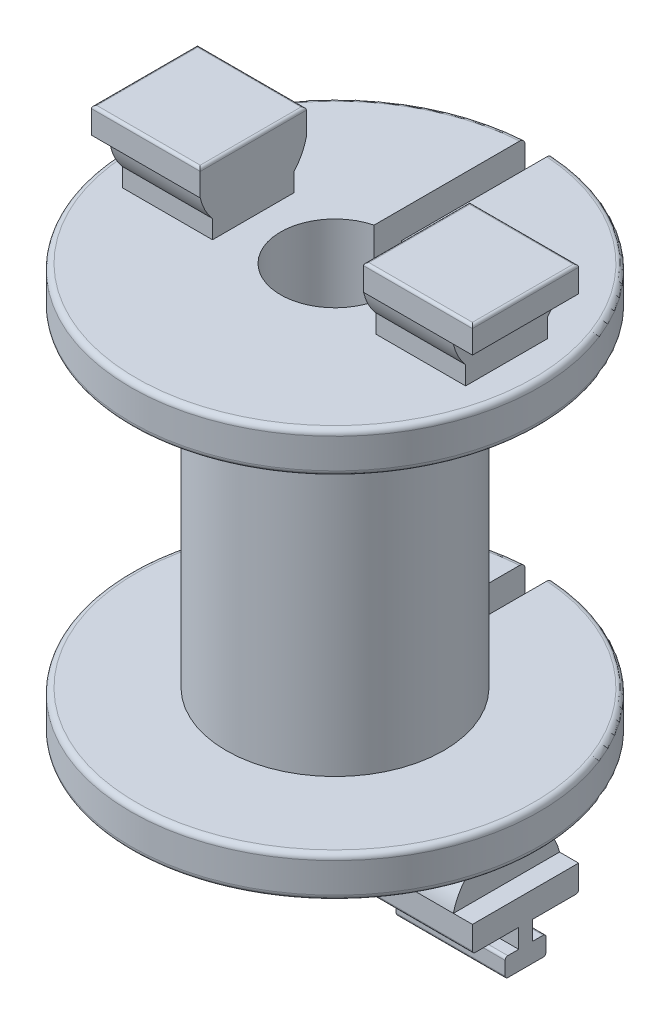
from build123d import *

# Parameters (mm, degrees)
SKETCH_1_R               = 7.5
EXTRUDE_1_DEPTH          = 1.5
SKETCH_2_R               = 4
EXTRUDE_2_DEPTH          = 12
SKETCH_3_R               = 7.5
EXTRUDE_3_DEPTH          = 1.5
SKETCH_4_R               = 2
CUT_EXTRUDE_1_DEPTH      = 19.371173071
EXTRUDE_4_DEPTH          = 6.3
SKETCH_6_W               = 3.9
SKETCH_6_H               = 0.944409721
EXTRUDE_5_DEPTH          = 0.7
CUT_EXTRUDE_2_DEPTH      = 21.46338193
MIRROR_2_COPY_1_SKETCH_W = 3.9
MIRROR_2_COPY_1_SKETCH_H = 0.944409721
MIRROR_2_COPY_1_DEPTH    = 0.7
EXTRUDE_6_DEPTH          = 7
EXTRUDE_6_DEPTH_BACK     = 7
CUT_EXTRUDE_3_DEPTH      = 21.46338193
CUT_EXTRUDE_3_DEPTH_BACK = 21.46338193
SKETCH_9_W               = 6
SKETCH_9_H               = 1.4
SKETCH_10_W              = 1
SKETCH_10_H              = 9
CUT_EXTRUDE_4_DEPTH      = 22.672794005
FILLET_1_R               = 0.2
FILLET_2_R               = 0.1


with BuildPart() as part:
    # Sketch 1 → Extrude 1 (new body)
    with BuildSketch(Plane(origin=(0, 0, 0), x_dir=(1, 0, 0), z_dir=(0, 1, 0))):
        with Locations(Location((0, 0, 0), (0, 0, 270))):
            Circle(SKETCH_1_R)
    extrude(amount=EXTRUDE_1_DEPTH)

    # Sketch 2 → Extrude 2 (add)
    with BuildSketch(Plane(origin=(0, 1.5, 0), x_dir=(1, 0, 0), z_dir=(0, 1, 0))):
        with Locations(Location((0, 0, 0), (0, 0, 270))):
            Circle(SKETCH_2_R)
    extrude(amount=EXTRUDE_2_DEPTH)

    # Sketch 3 → Extrude 3 (add)
    with BuildSketch(Plane(origin=(0, 13.5, 0), x_dir=(1, 0, 0), z_dir=(0, 1, 0))):
        with Locations(Location((0, 0, 0), (0, 0, 270))):
            Circle(SKETCH_3_R)
    extrude(amount=EXTRUDE_3_DEPTH)

    # Sketch 4 → Cut-Extrude 1 (cut, through all)
    with BuildSketch(Plane(origin=(0, 15, 0), x_dir=(1, 0, 0), z_dir=(0, 1, 0))):
        with Locations(Location((0, 0, 0), (0, 0, 270))):
            Circle(SKETCH_4_R)
    extrude(amount=-CUT_EXTRUDE_1_DEPTH, mode=Mode.SUBTRACT)

    # Sketch 5 → Extrude 4 (add, symmetric)
    with BuildSketch(Plane(origin=(0, 0, 0), x_dir=(0, 0, -1), z_dir=(1, 0, 0))):
        with BuildLine():
            Line((1.5, 15), (-1.5, 15))
            Line((-1.5, 15), (-1.5, 15.677124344))
            ThreePointArc((-1.5, 15.677124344), (-1.780042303, 16.088161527), (-1.95, 16.555590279))
            Line((-1.95, 16.555590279), (-1.95, 17.5))
            Line((-1.95, 17.5), (1.95, 17.5))
            Line((1.95, 17.5), (1.95, 16.555590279))
            ThreePointArc((1.95, 16.555590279), (1.780042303, 16.088161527), (1.5, 15.677124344))
            Line((1.5, 15.677124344), (1.5, 15))
        make_face()
    extrude_4 = extrude(amount=EXTRUDE_4_DEPTH, both=True)

    # Sketch 6 → Extrude 5 (add)
    with BuildSketch(Plane(origin=(6.3, 0, 0), x_dir=(0, 0, -1), z_dir=(1, 0, 0))):
        with Locations((0, 17.02779514)):
            Rectangle(SKETCH_6_W, SKETCH_6_H)
    extrude_5 = extrude(amount=EXTRUDE_5_DEPTH)

    # Mirror 1: Extrude 5 across plane
    add(extrude_5.mirror(Plane(origin=(0, 0, 0), x_dir=(0, 0, 1), z_dir=(1, 0, 0))))

    # Sketch 7 → Cut-Extrude 2 (cut, symmetric)
    with BuildSketch(Plane.XY):
        Polygon((0, 15), (-3, 15), (-3, 17.5), (3, 17.5), (3, 15), align=None)
    cut_extrude_2 = extrude(amount=CUT_EXTRUDE_2_DEPTH, both=True, mode=Mode.SUBTRACT)

    # Mirror 2: Extrude 4, Extrude 5, Cut-Extrude 2 across plane
    add(extrude_4.mirror(Plane.ZX.offset(7.5)))
    add(extrude_5.mirror(Plane.ZX.offset(7.5)))
    add(cut_extrude_2.mirror(Plane.ZX.offset(7.5)), mode=Mode.SUBTRACT)

    # Mirror 2 copy 1 sketch → Mirror 2 copy 1 (add)
    with BuildSketch(Plane(origin=(-6.3, 15, 0), x_dir=(0, 0, -1), z_dir=(-1, 0, 0))):
        with Locations((0, 17.02779514)):
            Rectangle(MIRROR_2_COPY_1_SKETCH_W, MIRROR_2_COPY_1_SKETCH_H)
    extrude(amount=MIRROR_2_COPY_1_DEPTH)

    # Sketch 8 → Extrude 6 (add, two sides: drawn at the far end of the back side and taken through both)
    with BuildSketch(Plane(origin=(0, 0, 0), x_dir=(0, 0, -1), z_dir=(1, 0, 0)).offset(-EXTRUDE_6_DEPTH_BACK)):
        Polygon((0.75, -3.9), (-0.75, -3.9), (-0.75, -3.2), (-0.25, -3.2), (-0.25, -2.5), (0.25, -2.5), (0.25, -3.2), (0.75, -3.2), align=None)
    extrude(amount=EXTRUDE_6_DEPTH + EXTRUDE_6_DEPTH_BACK)

    # Sketch 9 → Cut-Extrude 3 (cut, two sides: drawn at the far end of the back side and taken through both)
    with BuildSketch(Plane.XY.offset(-CUT_EXTRUDE_3_DEPTH_BACK)):
        with Locations((0, -3.2)):
            Rectangle(SKETCH_9_W, SKETCH_9_H)
    extrude(amount=CUT_EXTRUDE_3_DEPTH + CUT_EXTRUDE_3_DEPTH_BACK, mode=Mode.SUBTRACT)

    # Sketch 10 → Cut-Extrude 4 (cut, through all)
    with BuildSketch(Plane(origin=(0, 15, 0), x_dir=(1, 0, 0), z_dir=(0, 1, 0))):
        with Locations((0, 4.5)):
            Rectangle(SKETCH_10_W, SKETCH_10_H)
    extrude(amount=-CUT_EXTRUDE_4_DEPTH, mode=Mode.SUBTRACT)

    # Fillet 1
    fillet_1_edges = [part.edges().sort_by_distance(p)[0] for p in [
        (7.495827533, 15, 0.25013916),
        (-7.495827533, 13.5, 0.25013916),
        (7.495827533, 0, 0.25013916),
        (-7.495827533, 1.5, 0.25013916),
    ]]
    fillet(fillet_1_edges, radius=FILLET_1_R)

    # Fillet 2
    fillet_2_edges = [part.edges().sort_by_distance(p)[0] for p in [
        (-5, -2.5, -1.95),
        (-5, -2.5, 1.95),
        (5, -2.5, 1.95),
        (5, -2.5, -1.95),
        (-5, -3.2, -0.75),
        (-5, -3.9, -0.75),
        (-5, -3.9, 0.75),
        (-5, -3.2, 0.75),
        (-5, 17.5, 1.95),
        (-5, 17.5, -1.95),
        (5, -3.2, 0.75),
        (5, -3.9, 0.75),
        (5, -3.9, -0.75),
        (5, -3.2, -0.75),
        (7, 17.5, 0),
        (-7, 17.5, 0),
        (5, 17.5, -1.95),
        (5, 17.5, 1.95),
        (-3, 17.5, 0),
        (3, 17.5, 0),
    ]]
    fillet(fillet_2_edges, radius=FILLET_2_R)


solid = part.part
